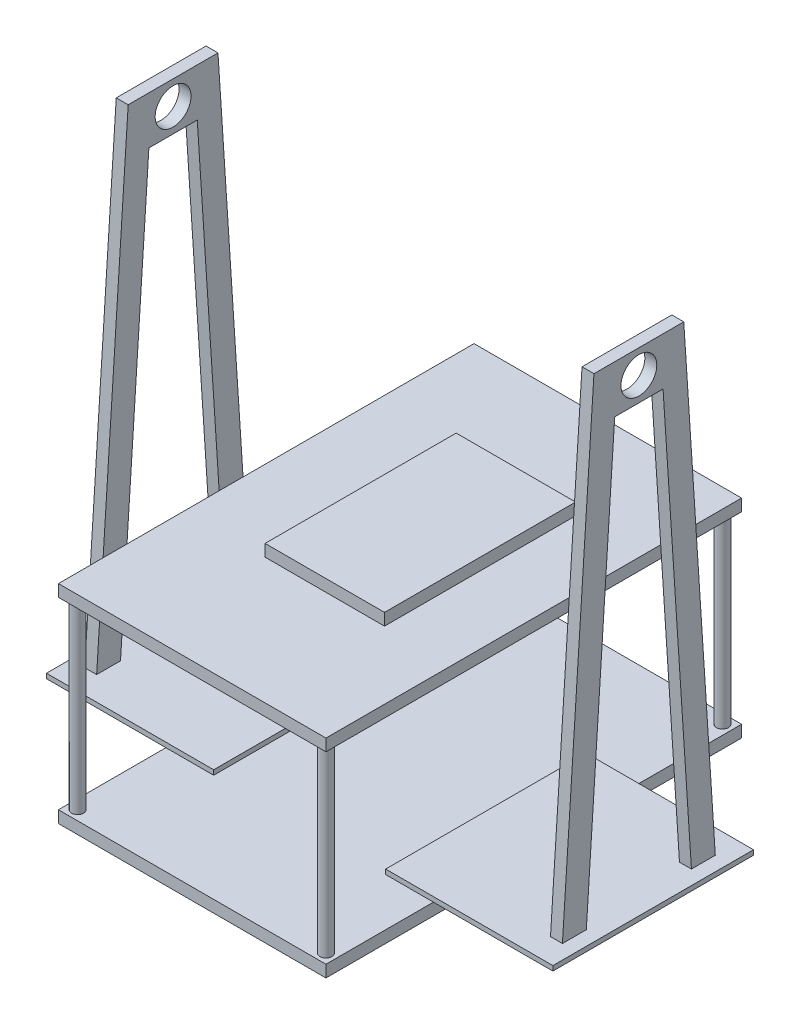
from build123d import *

# Parameters (mm, degrees)
SKETCH1_W               = 142.24
SKETCH1_H               = 6.35
BOSS_EXTRUDE1_DEPTH     = 220.98
SKETCH2_W               = 88.9
SKETCH2_H               = 106.68
BOSS_EXTRUDE2_DEPTH     = 2.54
SKETCH4_R               = 3.175
BOSS_EXTRUDE3_DEPTH     = 97.79
MIRROR2_COPY_1_SKETCH_R = 3.175
MIRROR2_COPY_1_DEPTH    = 97.79
SKETCH6_W               = 63.5
SKETCH6_H               = 101.6
BOSS_EXTRUDE4_DEPTH     = 6.35
BOSS_EXTRUDE6_DEPTH     = 6.35
SKETCH13_R              = 9.525
CUT_EXTRUDE1_DEPTH      = 430.801193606


with BuildPart() as part:
    # Sketch1 → Boss-Extrude1 (new body)
    with BuildSketch(Plane.XY):
        Rectangle(SKETCH1_W, SKETCH1_H)
    boss_extrude1 = extrude(amount=BOSS_EXTRUDE1_DEPTH)

    # Sketch2 → Boss-Extrude2 (add)
    with BuildSketch(Plane(origin=(0, 3.175, 0), x_dir=(1, 0, 0), z_dir=(0, 1, 0))):
        with Locations((-90.17, -110.49)):
            Rectangle(SKETCH2_W, SKETCH2_H)
        with Locations((90.17, -110.49)):
            Rectangle(SKETCH2_W, SKETCH2_H)
    extrude(amount=BOSS_EXTRUDE2_DEPTH)

    # Sketch4 → Boss-Extrude3 (add)
    with BuildSketch(Plane(origin=(0, 3.175, 0), x_dir=(1, 0, 0), z_dir=(0, 1, 0))):
        with Locations(Location((-66.04, -5.08, 0), (0, 0, 90))):
            Circle(SKETCH4_R)
    boss_extrude3 = extrude(amount=BOSS_EXTRUDE3_DEPTH)

    # Mirror1: Boss-Extrude3 across plane
    add(boss_extrude3.mirror(Plane(origin=(0, 0, 0), x_dir=(0, 0, 1), z_dir=(1, 0, 0))))

    # Mirror2: Boss-Extrude3 across plane
    add(boss_extrude3.mirror(Plane.XY.offset(110.49)))

    # Mirror2 copy 1 sketch → Mirror2 copy 1 (add)
    with BuildSketch(Plane(origin=(0, 3.175, 220.98), x_dir=(-1, 0, 0), z_dir=(0, 1, 0))):
        with Locations(Location((-66.04, -5.08, 0), (0, 0, 90))):
            Circle(MIRROR2_COPY_1_SKETCH_R)
    extrude(amount=MIRROR2_COPY_1_DEPTH)

    # Mirror3: Boss-Extrude1 across plane
    add(boss_extrude1.mirror(Plane.ZX.offset(52.07)))

    # Sketch6 → Boss-Extrude4 (add)
    with BuildSketch(Plane(origin=(0, 107.315, 0), x_dir=(1, 0, 0), z_dir=(0, 1, 0))):
        with Locations((3.419388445, -103.095211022)):
            Rectangle(SKETCH6_W, SKETCH6_H)
    extrude(amount=BOSS_EXTRUDE4_DEPTH)

    # Sketch12 → Boss-Extrude6 (add)
    with BuildSketch(Plane.ZY.offset(120.65)):
        Polygon((69.85, 5.715), (82.55, 5.715), (97.6376, 234.315), (123.3424, 234.315), (138.43, 5.715), (151.13, 5.715), (134.366, 259.715), (86.614, 259.715), align=None)
    boss_extrude6 = extrude(amount=BOSS_EXTRUDE6_DEPTH)

    # Sketch13 → Cut-Extrude1 (cut, symmetric)
    with BuildSketch(Plane.ZY.offset(127)):
        with Locations((110.49, 247.015)):
            Circle(SKETCH13_R)
    cut_extrude1 = extrude(amount=CUT_EXTRUDE1_DEPTH, both=True, mode=Mode.SUBTRACT)

    # Mirror5: Boss-Extrude6 across plane
    add(boss_extrude6.mirror(Plane(origin=(0, 0, 0), x_dir=(0, 0, 1), z_dir=(1, 0, 0))))

    # Mirror6: Cut-Extrude1 across plane
    add(cut_extrude1.mirror(Plane(origin=(0, 0, 0), x_dir=(0, 0, 1), z_dir=(1, 0, 0))), mode=Mode.SUBTRACT)


solid = part.part
